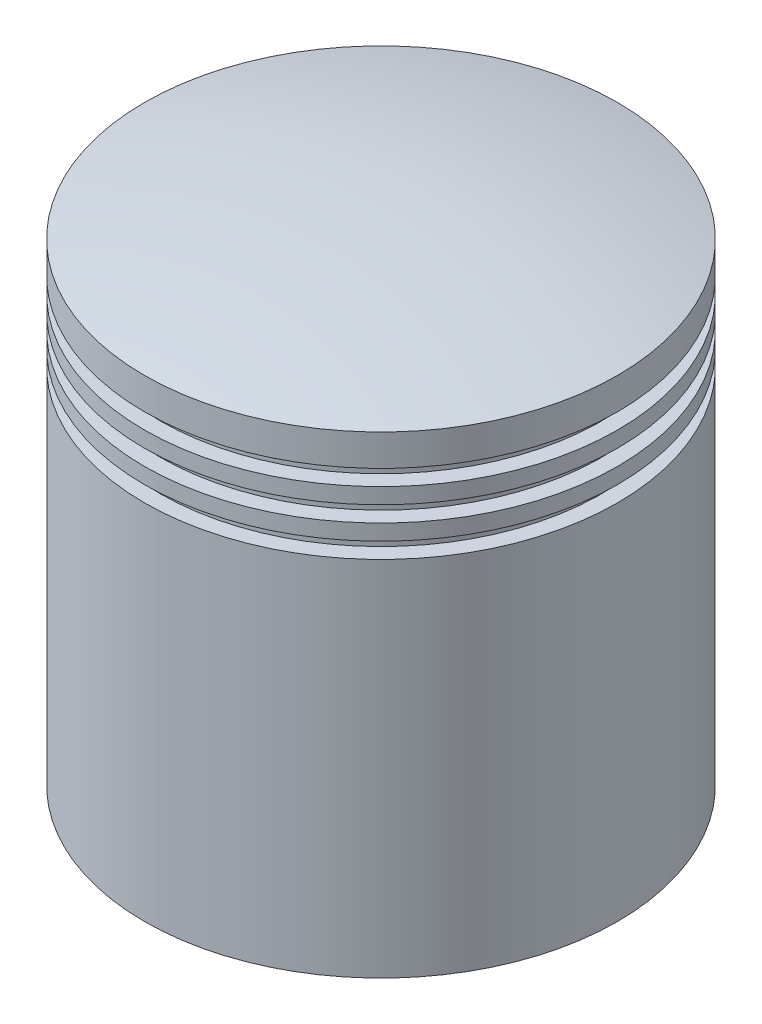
ISO-10303-21;
HEADER;
FILE_DESCRIPTION(('STEP AP214'),'2;1');
FILE_NAME('part.step','',(''),(''),'','','');
FILE_SCHEMA(('AUTOMOTIVE_DESIGN { 1 0 10303 214 1 1 1 1 }'));
ENDSEC;
DATA;
#1=APPLICATION_CONTEXT('core data for automotive mechanical design processes');
#2=APPLICATION_PROTOCOL_DEFINITION('international standard','automotive_design',2000,#1);
#3=PRODUCT_CONTEXT('',#1,'mechanical');
#4=PRODUCT('Part','Part','',(#3));
#5=PRODUCT_RELATED_PRODUCT_CATEGORY('part','',(#4));
#6=PRODUCT_DEFINITION_FORMATION('','',#4);
#7=PRODUCT_DEFINITION_CONTEXT('part definition',#1,'design');
#8=PRODUCT_DEFINITION('design','',#6,#7);
#9=PRODUCT_DEFINITION_SHAPE('','',#8);
#10=(LENGTH_UNIT() NAMED_UNIT(*) SI_UNIT(.MILLI.,.METRE.));
#11=(NAMED_UNIT(*) PLANE_ANGLE_UNIT() SI_UNIT($,.RADIAN.));
#12=(NAMED_UNIT(*) SI_UNIT($,.STERADIAN.) SOLID_ANGLE_UNIT());
#13=UNCERTAINTY_MEASURE_WITH_UNIT(LENGTH_MEASURE(1.E-05),#10,'distance_accuracy_value','');
#14=(GEOMETRIC_REPRESENTATION_CONTEXT(3) GLOBAL_UNCERTAINTY_ASSIGNED_CONTEXT((#13)) GLOBAL_UNIT_ASSIGNED_CONTEXT((#10,
#11,#12)) REPRESENTATION_CONTEXT('',''));
#15=CARTESIAN_POINT('',(0.,0.,0.));
#16=DIRECTION('',(0.,0.,1.));
#17=DIRECTION('',(1.,0.,0.));
#18=AXIS2_PLACEMENT_3D('',#15,#16,#17);
#19=CARTESIAN_POINT('',(60.,135.,0.));
#20=DIRECTION('',(0.,1.,0.));
#21=DIRECTION('',(0.,0.,1.));
#22=AXIS2_PLACEMENT_3D('',#19,#20,#21);
#23=PLANE('',#22);
#24=CARTESIAN_POINT('',(0.,135.,0.));
#25=DIRECTION('',(0.,1.,0.));
#26=DIRECTION('',(0.,0.,1.));
#27=AXIS2_PLACEMENT_3D('',#24,#25,#26);
#28=CIRCLE('',#27,60.);
#29=CARTESIAN_POINT('',(0.,135.,60.));
#30=VERTEX_POINT('',#29);
#31=EDGE_CURVE('E10',#30,#30,#28,.T.);
#32=ORIENTED_EDGE('',*,*,#31,.F.);
#33=EDGE_LOOP('',(#32));
#34=FACE_BOUND('',#33,.T.);
#35=ADVANCED_FACE('F36',(#34),#23,.F.);
#36=CARTESIAN_POINT('',(0.,160.,0.));
#37=DIRECTION('',(0.,1.,0.));
#38=DIRECTION('',(0.,0.,1.));
#39=AXIS2_PLACEMENT_3D('',#36,#37,#38);
#40=CYLINDRICAL_SURFACE('',#39,60.);
#41=CARTESIAN_POINT('',(0.,65.,0.));
#42=DIRECTION('',(0.,1.,0.));
#43=DIRECTION('',(0.,0.,1.));
#44=AXIS2_PLACEMENT_3D('',#41,#42,#43);
#45=CIRCLE('',#44,60.);
#46=CARTESIAN_POINT('',(0.,65.,60.));
#47=VERTEX_POINT('',#46);
#48=EDGE_CURVE('E42',#47,#47,#45,.T.);
#49=ORIENTED_EDGE('',*,*,#48,.F.);
#50=EDGE_LOOP('',(#49));
#51=FACE_BOUND('',#50,.T.);
#52=ORIENTED_EDGE('',*,*,#31,.T.);
#53=EDGE_LOOP('',(#52));
#54=FACE_BOUND('',#53,.T.);
#55=ADVANCED_FACE('F192',(#51,#54),#40,.F.);
#56=CARTESIAN_POINT('',(60.,65.,0.));
#57=DIRECTION('',(0.,1.,0.));
#58=DIRECTION('',(0.,0.,1.));
#59=AXIS2_PLACEMENT_3D('',#56,#57,#58);
#60=PLANE('',#59);
#61=CARTESIAN_POINT('',(0.,65.,0.));
#62=DIRECTION('',(0.,1.,0.));
#63=DIRECTION('',(0.,0.,1.));
#64=AXIS2_PLACEMENT_3D('',#61,#62,#63);
#65=CIRCLE('',#64,65.);
#66=CARTESIAN_POINT('',(0.,65.,65.));
#67=VERTEX_POINT('',#66);
#68=EDGE_CURVE('E46',#67,#67,#65,.T.);
#69=ORIENTED_EDGE('',*,*,#68,.F.);
#70=EDGE_LOOP('',(#69));
#71=FACE_BOUND('',#70,.T.);
#72=ORIENTED_EDGE('',*,*,#48,.T.);
#73=EDGE_LOOP('',(#72));
#74=FACE_BOUND('',#73,.T.);
#75=ADVANCED_FACE('F187',(#71,#74),#60,.F.);
#76=CARTESIAN_POINT('',(0.,160.,0.));
#77=DIRECTION('',(0.,1.,0.));
#78=DIRECTION('',(0.,0.,1.));
#79=AXIS2_PLACEMENT_3D('',#76,#77,#78);
#80=CYLINDRICAL_SURFACE('',#79,65.);
#81=CARTESIAN_POINT('',(0.,0.,0.));
#82=DIRECTION('',(0.,1.,0.));
#83=DIRECTION('',(0.,0.,1.));
#84=AXIS2_PLACEMENT_3D('',#81,#82,#83);
#85=CIRCLE('',#84,65.);
#86=CARTESIAN_POINT('',(0.,0.,65.));
#87=VERTEX_POINT('',#86);
#88=EDGE_CURVE('E50',#87,#87,#85,.T.);
#89=ORIENTED_EDGE('',*,*,#88,.F.);
#90=EDGE_LOOP('',(#89));
#91=FACE_BOUND('',#90,.T.);
#92=ORIENTED_EDGE('',*,*,#68,.T.);
#93=EDGE_LOOP('',(#92));
#94=FACE_BOUND('',#93,.T.);
#95=ADVANCED_FACE('F181',(#91,#94),#80,.F.);
#96=CARTESIAN_POINT('',(65.,0.,0.));
#97=DIRECTION('',(0.,1.,0.));
#98=DIRECTION('',(0.,0.,1.));
#99=AXIS2_PLACEMENT_3D('',#96,#97,#98);
#100=PLANE('',#99);
#101=CARTESIAN_POINT('',(0.,0.,0.));
#102=DIRECTION('',(0.,1.,0.));
#103=DIRECTION('',(0.,0.,1.));
#104=AXIS2_PLACEMENT_3D('',#101,#102,#103);
#105=CIRCLE('',#104,75.);
#106=CARTESIAN_POINT('',(0.,0.,75.));
#107=VERTEX_POINT('',#106);
#108=EDGE_CURVE('E55',#107,#107,#105,.T.);
#109=ORIENTED_EDGE('',*,*,#108,.F.);
#110=EDGE_LOOP('',(#109));
#111=FACE_BOUND('',#110,.T.);
#112=ORIENTED_EDGE('',*,*,#88,.T.);
#113=EDGE_LOOP('',(#112));
#114=FACE_BOUND('',#113,.T.);
#115=ADVANCED_FACE('F175',(#111,#114),#100,.F.);
#116=CARTESIAN_POINT('',(0.,160.,0.));
#117=DIRECTION('',(0.,1.,0.));
#118=DIRECTION('',(0.,0.,1.));
#119=AXIS2_PLACEMENT_3D('',#116,#117,#118);
#120=CYLINDRICAL_SURFACE('',#119,75.);
#121=CARTESIAN_POINT('',(0.,115.,0.));
#122=DIRECTION('',(0.,1.,0.));
#123=DIRECTION('',(0.,0.,1.));
#124=AXIS2_PLACEMENT_3D('',#121,#122,#123);
#125=CIRCLE('',#124,75.);
#126=CARTESIAN_POINT('',(0.,115.,75.));
#127=VERTEX_POINT('',#126);
#128=EDGE_CURVE('E58',#127,#127,#125,.T.);
#129=ORIENTED_EDGE('',*,*,#128,.F.);
#130=EDGE_LOOP('',(#129));
#131=FACE_BOUND('',#130,.T.);
#132=ORIENTED_EDGE('',*,*,#108,.T.);
#133=EDGE_LOOP('',(#132));
#134=FACE_BOUND('',#133,.T.);
#135=ADVANCED_FACE('F169',(#131,#134),#120,.T.);
#136=CARTESIAN_POINT('',(75.,115.,0.));
#137=DIRECTION('',(0.,-1.,0.));
#138=DIRECTION('',(0.,0.,-1.));
#139=AXIS2_PLACEMENT_3D('',#136,#137,#138);
#140=PLANE('',#139);
#141=CARTESIAN_POINT('',(0.,115.,0.));
#142=DIRECTION('',(0.,1.,0.));
#143=DIRECTION('',(0.,0.,1.));
#144=AXIS2_PLACEMENT_3D('',#141,#142,#143);
#145=CIRCLE('',#144,70.);
#146=CARTESIAN_POINT('',(0.,115.,70.));
#147=VERTEX_POINT('',#146);
#148=EDGE_CURVE('E61',#147,#147,#145,.T.);
#149=ORIENTED_EDGE('',*,*,#148,.F.);
#150=EDGE_LOOP('',(#149));
#151=FACE_BOUND('',#150,.T.);
#152=ORIENTED_EDGE('',*,*,#128,.T.);
#153=EDGE_LOOP('',(#152));
#154=FACE_BOUND('',#153,.T.);
#155=ADVANCED_FACE('F163',(#151,#154),#140,.F.);
#156=CARTESIAN_POINT('',(0.,160.,0.));
#157=DIRECTION('',(0.,1.,0.));
#158=DIRECTION('',(0.,0.,1.));
#159=AXIS2_PLACEMENT_3D('',#156,#157,#158);
#160=CYLINDRICAL_SURFACE('',#159,70.);
#161=CARTESIAN_POINT('',(0.,120.,0.));
#162=DIRECTION('',(0.,1.,0.));
#163=DIRECTION('',(0.,0.,1.));
#164=AXIS2_PLACEMENT_3D('',#161,#162,#163);
#165=CIRCLE('',#164,70.);
#166=CARTESIAN_POINT('',(0.,120.,70.));
#167=VERTEX_POINT('',#166);
#168=EDGE_CURVE('E64',#167,#167,#165,.T.);
#169=ORIENTED_EDGE('',*,*,#168,.F.);
#170=EDGE_LOOP('',(#169));
#171=FACE_BOUND('',#170,.T.);
#172=ORIENTED_EDGE('',*,*,#148,.T.);
#173=EDGE_LOOP('',(#172));
#174=FACE_BOUND('',#173,.T.);
#175=ADVANCED_FACE('F157',(#171,#174),#160,.T.);
#176=CARTESIAN_POINT('',(70.,120.,0.));
#177=DIRECTION('',(0.,1.,0.));
#178=DIRECTION('',(0.,0.,1.));
#179=AXIS2_PLACEMENT_3D('',#176,#177,#178);
#180=PLANE('',#179);
#181=CARTESIAN_POINT('',(0.,120.,0.));
#182=DIRECTION('',(0.,1.,0.));
#183=DIRECTION('',(0.,0.,1.));
#184=AXIS2_PLACEMENT_3D('',#181,#182,#183);
#185=CIRCLE('',#184,75.);
#186=CARTESIAN_POINT('',(0.,120.,75.));
#187=VERTEX_POINT('',#186);
#188=EDGE_CURVE('E67',#187,#187,#185,.T.);
#189=ORIENTED_EDGE('',*,*,#188,.F.);
#190=EDGE_LOOP('',(#189));
#191=FACE_BOUND('',#190,.T.);
#192=ORIENTED_EDGE('',*,*,#168,.T.);
#193=EDGE_LOOP('',(#192));
#194=FACE_BOUND('',#193,.T.);
#195=ADVANCED_FACE('F151',(#191,#194),#180,.F.);
#196=CARTESIAN_POINT('',(0.,160.,0.));
#197=DIRECTION('',(0.,1.,0.));
#198=DIRECTION('',(0.,0.,1.));
#199=AXIS2_PLACEMENT_3D('',#196,#197,#198);
#200=CYLINDRICAL_SURFACE('',#199,75.);
#201=CARTESIAN_POINT('',(0.,125.,0.));
#202=DIRECTION('',(0.,1.,0.));
#203=DIRECTION('',(0.,0.,1.));
#204=AXIS2_PLACEMENT_3D('',#201,#202,#203);
#205=CIRCLE('',#204,75.);
#206=CARTESIAN_POINT('',(0.,125.,75.));
#207=VERTEX_POINT('',#206);
#208=EDGE_CURVE('E70',#207,#207,#205,.T.);
#209=ORIENTED_EDGE('',*,*,#208,.F.);
#210=EDGE_LOOP('',(#209));
#211=FACE_BOUND('',#210,.T.);
#212=ORIENTED_EDGE('',*,*,#188,.T.);
#213=EDGE_LOOP('',(#212));
#214=FACE_BOUND('',#213,.T.);
#215=ADVANCED_FACE('F145',(#211,#214),#200,.T.);
#216=CARTESIAN_POINT('',(75.,125.,0.));
#217=DIRECTION('',(0.,-1.,0.));
#218=DIRECTION('',(0.,0.,-1.));
#219=AXIS2_PLACEMENT_3D('',#216,#217,#218);
#220=PLANE('',#219);
#221=CARTESIAN_POINT('',(0.,125.,0.));
#222=DIRECTION('',(0.,1.,0.));
#223=DIRECTION('',(0.,0.,1.));
#224=AXIS2_PLACEMENT_3D('',#221,#222,#223);
#225=CIRCLE('',#224,70.);
#226=CARTESIAN_POINT('',(0.,125.,70.));
#227=VERTEX_POINT('',#226);
#228=EDGE_CURVE('E73',#227,#227,#225,.T.);
#229=ORIENTED_EDGE('',*,*,#228,.F.);
#230=EDGE_LOOP('',(#229));
#231=FACE_BOUND('',#230,.T.);
#232=ORIENTED_EDGE('',*,*,#208,.T.);
#233=EDGE_LOOP('',(#232));
#234=FACE_BOUND('',#233,.T.);
#235=ADVANCED_FACE('F139',(#231,#234),#220,.F.);
#236=CARTESIAN_POINT('',(0.,160.,0.));
#237=DIRECTION('',(0.,1.,0.));
#238=DIRECTION('',(0.,0.,1.));
#239=AXIS2_PLACEMENT_3D('',#236,#237,#238);
#240=CYLINDRICAL_SURFACE('',#239,70.);
#241=CARTESIAN_POINT('',(0.,130.,0.));
#242=DIRECTION('',(0.,1.,0.));
#243=DIRECTION('',(0.,0.,1.));
#244=AXIS2_PLACEMENT_3D('',#241,#242,#243);
#245=CIRCLE('',#244,70.);
#246=CARTESIAN_POINT('',(0.,130.,70.));
#247=VERTEX_POINT('',#246);
#248=EDGE_CURVE('E76',#247,#247,#245,.T.);
#249=ORIENTED_EDGE('',*,*,#248,.F.);
#250=EDGE_LOOP('',(#249));
#251=FACE_BOUND('',#250,.T.);
#252=ORIENTED_EDGE('',*,*,#228,.T.);
#253=EDGE_LOOP('',(#252));
#254=FACE_BOUND('',#253,.T.);
#255=ADVANCED_FACE('F133',(#251,#254),#240,.T.);
#256=CARTESIAN_POINT('',(70.,130.,0.));
#257=DIRECTION('',(0.,1.,0.));
#258=DIRECTION('',(0.,0.,1.));
#259=AXIS2_PLACEMENT_3D('',#256,#257,#258);
#260=PLANE('',#259);
#261=CARTESIAN_POINT('',(0.,130.,0.));
#262=DIRECTION('',(0.,1.,0.));
#263=DIRECTION('',(0.,0.,1.));
#264=AXIS2_PLACEMENT_3D('',#261,#262,#263);
#265=CIRCLE('',#264,75.);
#266=CARTESIAN_POINT('',(0.,130.,75.));
#267=VERTEX_POINT('',#266);
#268=EDGE_CURVE('E79',#267,#267,#265,.T.);
#269=ORIENTED_EDGE('',*,*,#268,.F.);
#270=EDGE_LOOP('',(#269));
#271=FACE_BOUND('',#270,.T.);
#272=ORIENTED_EDGE('',*,*,#248,.T.);
#273=EDGE_LOOP('',(#272));
#274=FACE_BOUND('',#273,.T.);
#275=ADVANCED_FACE('F127',(#271,#274),#260,.F.);
#276=CARTESIAN_POINT('',(0.,160.,0.));
#277=DIRECTION('',(0.,1.,0.));
#278=DIRECTION('',(0.,0.,1.));
#279=AXIS2_PLACEMENT_3D('',#276,#277,#278);
#280=CYLINDRICAL_SURFACE('',#279,75.);
#281=CARTESIAN_POINT('',(0.,135.,0.));
#282=DIRECTION('',(0.,1.,0.));
#283=DIRECTION('',(0.,0.,1.));
#284=AXIS2_PLACEMENT_3D('',#281,#282,#283);
#285=CIRCLE('',#284,75.);
#286=CARTESIAN_POINT('',(0.,135.,75.));
#287=VERTEX_POINT('',#286);
#288=EDGE_CURVE('E82',#287,#287,#285,.T.);
#289=ORIENTED_EDGE('',*,*,#288,.F.);
#290=EDGE_LOOP('',(#289));
#291=FACE_BOUND('',#290,.T.);
#292=ORIENTED_EDGE('',*,*,#268,.T.);
#293=EDGE_LOOP('',(#292));
#294=FACE_BOUND('',#293,.T.);
#295=ADVANCED_FACE('F121',(#291,#294),#280,.T.);
#296=CARTESIAN_POINT('',(75.,135.,0.));
#297=DIRECTION('',(0.,-1.,0.));
#298=DIRECTION('',(0.,0.,-1.));
#299=AXIS2_PLACEMENT_3D('',#296,#297,#298);
#300=PLANE('',#299);
#301=CARTESIAN_POINT('',(0.,135.,0.));
#302=DIRECTION('',(0.,1.,0.));
#303=DIRECTION('',(0.,0.,1.));
#304=AXIS2_PLACEMENT_3D('',#301,#302,#303);
#305=CIRCLE('',#304,70.);
#306=CARTESIAN_POINT('',(0.,135.,70.));
#307=VERTEX_POINT('',#306);
#308=EDGE_CURVE('E85',#307,#307,#305,.T.);
#309=ORIENTED_EDGE('',*,*,#308,.F.);
#310=EDGE_LOOP('',(#309));
#311=FACE_BOUND('',#310,.T.);
#312=ORIENTED_EDGE('',*,*,#288,.T.);
#313=EDGE_LOOP('',(#312));
#314=FACE_BOUND('',#313,.T.);
#315=ADVANCED_FACE('F115',(#311,#314),#300,.F.);
#316=CARTESIAN_POINT('',(0.,160.,0.));
#317=DIRECTION('',(0.,1.,0.));
#318=DIRECTION('',(0.,0.,1.));
#319=AXIS2_PLACEMENT_3D('',#316,#317,#318);
#320=CYLINDRICAL_SURFACE('',#319,70.);
#321=CARTESIAN_POINT('',(0.,140.,0.));
#322=DIRECTION('',(0.,1.,0.));
#323=DIRECTION('',(0.,0.,1.));
#324=AXIS2_PLACEMENT_3D('',#321,#322,#323);
#325=CIRCLE('',#324,70.);
#326=CARTESIAN_POINT('',(0.,140.,70.));
#327=VERTEX_POINT('',#326);
#328=EDGE_CURVE('E88',#327,#327,#325,.T.);
#329=ORIENTED_EDGE('',*,*,#328,.F.);
#330=EDGE_LOOP('',(#329));
#331=FACE_BOUND('',#330,.T.);
#332=ORIENTED_EDGE('',*,*,#308,.T.);
#333=EDGE_LOOP('',(#332));
#334=FACE_BOUND('',#333,.T.);
#335=ADVANCED_FACE('F109',(#331,#334),#320,.T.);
#336=CARTESIAN_POINT('',(70.,140.,0.));
#337=DIRECTION('',(0.,1.,0.));
#338=DIRECTION('',(0.,0.,1.));
#339=AXIS2_PLACEMENT_3D('',#336,#337,#338);
#340=PLANE('',#339);
#341=CARTESIAN_POINT('',(0.,140.,0.));
#342=DIRECTION('',(0.,1.,0.));
#343=DIRECTION('',(0.,0.,1.));
#344=AXIS2_PLACEMENT_3D('',#341,#342,#343);
#345=CIRCLE('',#344,75.);
#346=CARTESIAN_POINT('',(0.,140.,75.));
#347=VERTEX_POINT('',#346);
#348=EDGE_CURVE('E91',#347,#347,#345,.T.);
#349=ORIENTED_EDGE('',*,*,#348,.F.);
#350=EDGE_LOOP('',(#349));
#351=FACE_BOUND('',#350,.T.);
#352=ORIENTED_EDGE('',*,*,#328,.T.);
#353=EDGE_LOOP('',(#352));
#354=FACE_BOUND('',#353,.T.);
#355=ADVANCED_FACE('F103',(#351,#354),#340,.F.);
#356=CARTESIAN_POINT('',(0.,160.,0.));
#357=DIRECTION('',(0.,1.,0.));
#358=DIRECTION('',(0.,0.,1.));
#359=AXIS2_PLACEMENT_3D('',#356,#357,#358);
#360=CYLINDRICAL_SURFACE('',#359,75.);
#361=CARTESIAN_POINT('',(0.,150.,0.));
#362=DIRECTION('',(0.,1.,0.));
#363=DIRECTION('',(0.,0.,1.));
#364=AXIS2_PLACEMENT_3D('',#361,#362,#363);
#365=CIRCLE('',#364,75.);
#366=CARTESIAN_POINT('',(0.,150.,75.));
#367=VERTEX_POINT('',#366);
#368=EDGE_CURVE('E94',#367,#367,#365,.T.);
#369=ORIENTED_EDGE('',*,*,#368,.F.);
#370=EDGE_LOOP('',(#369));
#371=FACE_BOUND('',#370,.T.);
#372=ORIENTED_EDGE('',*,*,#348,.T.);
#373=EDGE_LOOP('',(#372));
#374=FACE_BOUND('',#373,.T.);
#375=ADVANCED_FACE('F100',(#371,#374),#360,.T.);
#376=CARTESIAN_POINT('',(0.,-126.25,0.));
#377=DIRECTION('',(0.,1.,0.));
#378=DIRECTION('',(1.,0.,0.));
#379=AXIS2_PLACEMENT_3D('',#376,#377,#378);
#380=SPHERICAL_SURFACE('',#379,286.25);
#381=ORIENTED_EDGE('',*,*,#368,.T.);
#382=EDGE_LOOP('',(#381));
#383=FACE_BOUND('',#382,.T.);
#384=ADVANCED_FACE('F98',(#383),#380,.T.);
#385=CLOSED_SHELL('',(#35,#55,#75,#95,#115,#135,#155,#175,#195,#215,#235,#255,#275,#295,#315,
#335,#355,#375,#384));
#386=MANIFOLD_SOLID_BREP('B2',#385);
#387=ADVANCED_BREP_SHAPE_REPRESENTATION('',(#18,#386),#14);
#388=SHAPE_DEFINITION_REPRESENTATION(#9,#387);
ENDSEC;
END-ISO-10303-21;
